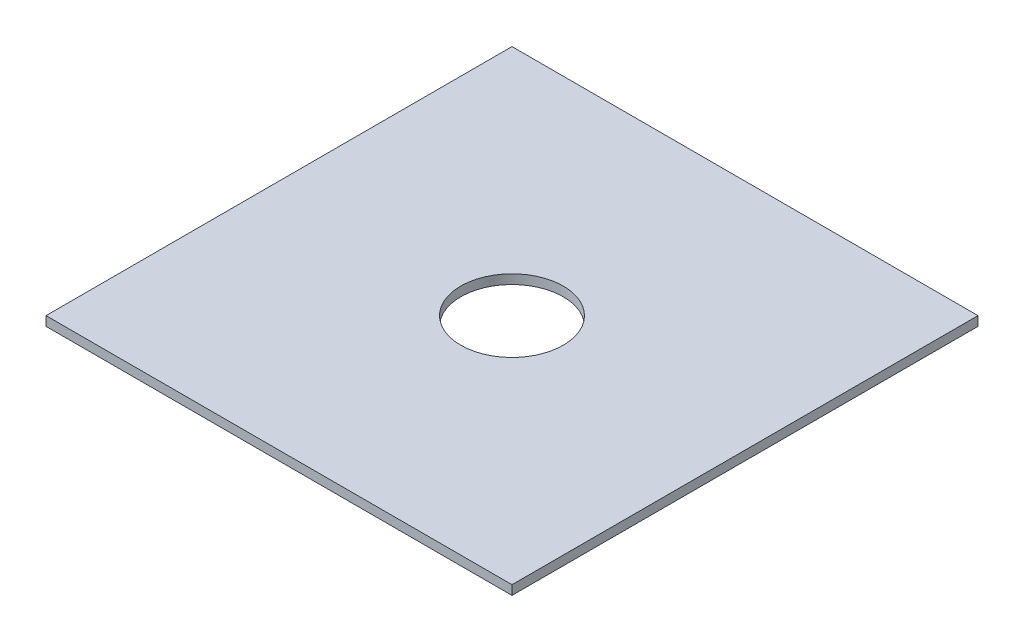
from build123d import *

# Parameters (mm, degrees)
SKETCH1_W           = 100
SKETCH1_H           = 100
SKETCH1_R           = 11
BOSS_EXTRUDE1_DEPTH = 2


with BuildPart() as part:
    # Sketch1 → Boss-Extrude1 (new body)
    with BuildSketch(Plane(origin=(0, 0, 0), x_dir=(1, 0, 0), z_dir=(0, 1, 0))):
        Rectangle(SKETCH1_W, SKETCH1_H)
        with Locations(Location((0, 0, 0), (0, 0, 270))):
            Circle(SKETCH1_R, mode=Mode.SUBTRACT)
    extrude(amount=BOSS_EXTRUDE1_DEPTH)


solid = part.part
